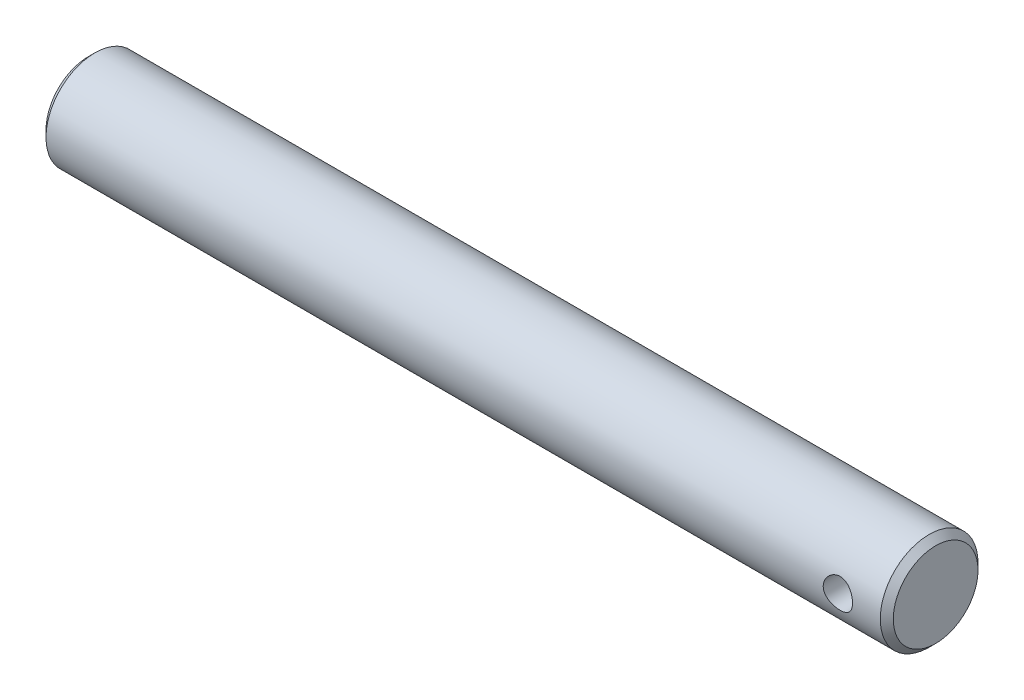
ISO-10303-21;
HEADER;
FILE_DESCRIPTION(('STEP AP214'),'2;1');
FILE_NAME('part.step','',(''),(''),'','','');
FILE_SCHEMA(('AUTOMOTIVE_DESIGN { 1 0 10303 214 1 1 1 1 }'));
ENDSEC;
DATA;
#1=APPLICATION_CONTEXT('core data for automotive mechanical design processes');
#2=APPLICATION_PROTOCOL_DEFINITION('international standard','automotive_design',2000,#1);
#3=PRODUCT_CONTEXT('',#1,'mechanical');
#4=PRODUCT('Part','Part','',(#3));
#5=PRODUCT_RELATED_PRODUCT_CATEGORY('part','',(#4));
#6=PRODUCT_DEFINITION_FORMATION('','',#4);
#7=PRODUCT_DEFINITION_CONTEXT('part definition',#1,'design');
#8=PRODUCT_DEFINITION('design','',#6,#7);
#9=PRODUCT_DEFINITION_SHAPE('','',#8);
#10=(LENGTH_UNIT() NAMED_UNIT(*) SI_UNIT(.MILLI.,.METRE.));
#11=(NAMED_UNIT(*) PLANE_ANGLE_UNIT() SI_UNIT($,.RADIAN.));
#12=(NAMED_UNIT(*) SI_UNIT($,.STERADIAN.) SOLID_ANGLE_UNIT());
#13=UNCERTAINTY_MEASURE_WITH_UNIT(LENGTH_MEASURE(1.E-05),#10,'distance_accuracy_value','');
#14=(GEOMETRIC_REPRESENTATION_CONTEXT(3) GLOBAL_UNCERTAINTY_ASSIGNED_CONTEXT((#13)) GLOBAL_UNIT_ASSIGNED_CONTEXT((#10,
#11,#12)) REPRESENTATION_CONTEXT('',''));
#15=CARTESIAN_POINT('',(0.,0.,0.));
#16=DIRECTION('',(0.,0.,1.));
#17=DIRECTION('',(1.,0.,0.));
#18=AXIS2_PLACEMENT_3D('',#15,#16,#17);
#19=CARTESIAN_POINT('',(0.,0.,0.));
#20=DIRECTION('',(1.,0.,0.));
#21=DIRECTION('',(0.,0.,-1.));
#22=AXIS2_PLACEMENT_3D('',#19,#20,#21);
#23=PLANE('',#22);
#24=CARTESIAN_POINT('',(0.,0.,0.));
#25=DIRECTION('',(1.,0.,0.));
#26=DIRECTION('',(0.,0.,-1.));
#27=AXIS2_PLACEMENT_3D('',#24,#25,#26);
#28=CIRCLE('',#27,6.49999999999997);
#29=CARTESIAN_POINT('',(0.,0.,-6.49999999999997));
#30=VERTEX_POINT('',#29);
#31=EDGE_CURVE('E36',#30,#30,#28,.T.);
#32=ORIENTED_EDGE('',*,*,#31,.T.);
#33=EDGE_LOOP('',(#32));
#34=FACE_BOUND('',#33,.T.);
#35=ADVANCED_FACE('F22',(#34),#23,.T.);
#36=CARTESIAN_POINT('',(40.,0.,0.));
#37=DIRECTION('',(1.,0.,0.));
#38=DIRECTION('',(0.,0.,-1.));
#39=AXIS2_PLACEMENT_3D('',#36,#37,#38);
#40=CYLINDRICAL_SURFACE('',#39,7.49999999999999);
#41=CARTESIAN_POINT('',(-1.00000000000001,0.,0.));
#42=DIRECTION('',(1.,0.,0.));
#43=DIRECTION('',(0.,0.,-1.));
#44=AXIS2_PLACEMENT_3D('',#41,#42,#43);
#45=CIRCLE('',#44,7.49999999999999);
#46=CARTESIAN_POINT('',(-1.00000000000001,0.,-7.49999999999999));
#47=VERTEX_POINT('',#46);
#48=EDGE_CURVE('E28',#47,#47,#45,.F.);
#49=ORIENTED_EDGE('',*,*,#48,.T.);
#50=EDGE_LOOP('',(#49));
#51=FACE_BOUND('',#50,.T.);
#52=CARTESIAN_POINT('',(-129.,0.,0.));
#53=DIRECTION('',(-1.,0.,0.));
#54=DIRECTION('',(0.,0.,1.));
#55=AXIS2_PLACEMENT_3D('',#52,#53,#54);
#56=CIRCLE('',#55,7.49999999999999);
#57=CARTESIAN_POINT('',(-129.,0.,7.49999999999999));
#58=VERTEX_POINT('',#57);
#59=EDGE_CURVE('E32',#58,#58,#56,.F.);
#60=ORIENTED_EDGE('',*,*,#59,.T.);
#61=EDGE_LOOP('',(#60));
#62=FACE_BOUND('',#61,.T.);
#63=CARTESIAN_POINT('',(-9.75,0.,-7.49999999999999));
#64=CARTESIAN_POINT('',(-9.74999850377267,0.12343291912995,-7.49999893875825));
#65=CARTESIAN_POINT('',(-9.73980920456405,0.246880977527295,-7.4969237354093));
#66=CARTESIAN_POINT('',(-9.69941796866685,0.490182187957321,-7.48495658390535));
#67=CARTESIAN_POINT('',(-9.66921006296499,0.61003425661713,-7.47606290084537));
#68=CARTESIAN_POINT('',(-9.58988097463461,0.84259906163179,-7.45343328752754));
#69=CARTESIAN_POINT('',(-9.5407876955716,0.955322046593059,-7.43970450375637));
#70=CARTESIAN_POINT('',(-9.42519586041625,1.1709362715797,-7.40883163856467));
#71=CARTESIAN_POINT('',(-9.35869498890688,1.2738262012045,-7.39168710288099));
#72=CARTESIAN_POINT('',(-9.208163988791,1.46980769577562,-7.3552610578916));
#73=CARTESIAN_POINT('',(-9.12372506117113,1.56257710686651,-7.33593575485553));
#74=CARTESIAN_POINT('',(-8.94058615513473,1.73287381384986,-7.29758751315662));
#75=CARTESIAN_POINT('',(-8.84188378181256,1.81039854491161,-7.27856462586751));
#76=CARTESIAN_POINT('',(-8.63029387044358,1.94970056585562,-7.24251170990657));
#77=CARTESIAN_POINT('',(-8.51713730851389,2.0110846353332,-7.22553609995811));
#78=CARTESIAN_POINT('',(-8.28151611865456,2.11382092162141,-7.19615430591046));
#79=CARTESIAN_POINT('',(-8.15905373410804,2.1551779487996,-7.18374702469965));
#80=CARTESIAN_POINT('',(-7.91191460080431,2.21552450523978,-7.16536306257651));
#81=CARTESIAN_POINT('',(-7.78739588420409,2.23510794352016,-7.15921603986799));
#82=CARTESIAN_POINT('',(-7.53670026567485,2.25320595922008,-7.1535418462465));
#83=CARTESIAN_POINT('',(-7.41052377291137,2.25172564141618,-7.15401307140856));
#84=CARTESIAN_POINT('',(-7.16492413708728,2.22820465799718,-7.16137116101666));
#85=CARTESIAN_POINT('',(-7.04542162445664,2.20690807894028,-7.1680258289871));
#86=CARTESIAN_POINT('',(-6.81177032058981,2.14556130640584,-7.18662534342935));
#87=CARTESIAN_POINT('',(-6.6976220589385,2.10550926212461,-7.19857071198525));
#88=CARTESIAN_POINT('',(-6.47609947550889,2.00724039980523,-7.22659099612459));
#89=CARTESIAN_POINT('',(-6.36883937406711,1.94878225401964,-7.24272024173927));
#90=CARTESIAN_POINT('',(-6.16540196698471,1.81552833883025,-7.27726480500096));
#91=CARTESIAN_POINT('',(-6.06922735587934,1.74072861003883,-7.29568067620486));
#92=CARTESIAN_POINT('',(-5.88647071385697,1.5732193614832,-7.33366516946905));
#93=CARTESIAN_POINT('',(-5.8004570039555,1.47989236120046,-7.35324981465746));
#94=CARTESIAN_POINT('',(-5.64516902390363,1.27989488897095,-7.39068366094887));
#95=CARTESIAN_POINT('',(-5.57589580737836,1.17322357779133,-7.40853275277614));
#96=CARTESIAN_POINT('',(-5.4557101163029,0.948532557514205,-7.44064740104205));
#97=CARTESIAN_POINT('',(-5.40492372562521,0.830441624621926,-7.4548881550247));
#98=CARTESIAN_POINT('',(-5.32410061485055,0.586868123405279,-7.47800282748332));
#99=CARTESIAN_POINT('',(-5.29405810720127,0.461387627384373,-7.48687824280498));
#100=CARTESIAN_POINT('',(-5.25652173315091,0.211428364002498,-7.49802546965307));
#101=CARTESIAN_POINT('',(-5.24825762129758,0.0870751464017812,-7.50052275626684));
#102=CARTESIAN_POINT('',(-5.25235373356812,-0.161249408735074,-7.49929384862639));
#103=CARTESIAN_POINT('',(-5.26471120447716,-0.28522079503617,-7.49556848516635));
#104=CARTESIAN_POINT('',(-5.30907691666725,-0.526355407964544,-7.48246045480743));
#105=CARTESIAN_POINT('',(-5.34063508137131,-0.643609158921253,-7.47320744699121));
#106=CARTESIAN_POINT('',(-5.4219648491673,-0.871131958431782,-7.45011521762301));
#107=CARTESIAN_POINT('',(-5.47173864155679,-0.981400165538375,-7.4362754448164));
#108=CARTESIAN_POINT('',(-5.5893797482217,-1.19465578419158,-7.40504481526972));
#109=CARTESIAN_POINT('',(-5.65763901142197,-1.2974157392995,-7.38757921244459));
#110=CARTESIAN_POINT('',(-5.80983713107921,-1.49028496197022,-7.35110203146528));
#111=CARTESIAN_POINT('',(-5.89377991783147,-1.58039104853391,-7.33209006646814));
#112=CARTESIAN_POINT('',(-6.07858096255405,-1.74878616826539,-7.29379757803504));
#113=CARTESIAN_POINT('',(-6.17994281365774,-1.82652721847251,-7.27453237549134));
#114=CARTESIAN_POINT('',(-6.39469190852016,-1.96393492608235,-7.23864772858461));
#115=CARTESIAN_POINT('',(-6.50807883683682,-2.02360205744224,-7.2220282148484));
#116=CARTESIAN_POINT('',(-6.74329873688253,-2.12276020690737,-7.19350784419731));
#117=CARTESIAN_POINT('',(-6.86508927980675,-2.16234520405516,-7.18158506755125));
#118=CARTESIAN_POINT('',(-7.11403195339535,-2.2203259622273,-7.16387391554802));
#119=CARTESIAN_POINT('',(-7.24118223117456,-2.23872898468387,-7.15808343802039));
#120=CARTESIAN_POINT('',(-7.49154227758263,-2.25332976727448,-7.15349958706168));
#121=CARTESIAN_POINT('',(-7.61469547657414,-2.25042082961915,-7.15442471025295));
#122=CARTESIAN_POINT('',(-7.85867115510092,-2.22461258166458,-7.1624910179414));
#123=CARTESIAN_POINT('',(-7.97949372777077,-2.20171407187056,-7.16963195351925));
#124=CARTESIAN_POINT('',(-8.21391809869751,-2.13715333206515,-7.18913645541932));
#125=CARTESIAN_POINT('',(-8.32759093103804,-2.09572763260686,-7.201434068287));
#126=CARTESIAN_POINT('',(-8.54646365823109,-1.99547260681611,-7.22985418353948));
#127=CARTESIAN_POINT('',(-8.65166192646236,-1.93663994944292,-7.24597741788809));
#128=CARTESIAN_POINT('',(-8.8547446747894,-1.80073145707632,-7.28096514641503));
#129=CARTESIAN_POINT('',(-8.95222314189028,-1.72306914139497,-7.29990810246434));
#130=CARTESIAN_POINT('',(-9.13305374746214,-1.55276151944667,-7.33801980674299));
#131=CARTESIAN_POINT('',(-9.21640220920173,-1.46011232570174,-7.35718861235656));
#132=CARTESIAN_POINT('',(-9.36903511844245,-1.25919864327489,-7.39426404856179));
#133=CARTESIAN_POINT('',(-9.43783717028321,-1.15055682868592,-7.41211739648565));
#134=CARTESIAN_POINT('',(-9.55610275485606,-0.92271206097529,-7.44391020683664));
#135=CARTESIAN_POINT('',(-9.60557533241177,-0.803514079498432,-7.45785149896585));
#136=CARTESIAN_POINT('',(-9.67934291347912,-0.571136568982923,-7.47903262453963));
#137=CARTESIAN_POINT('',(-9.70576750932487,-0.458680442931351,-7.48683041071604));
#138=CARTESIAN_POINT('',(-9.74109528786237,-0.230820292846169,-7.49731416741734));
#139=CARTESIAN_POINT('',(-9.75000139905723,-0.115416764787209,-7.50000099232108));
#140=CARTESIAN_POINT('',(-9.75,0.,-7.49999999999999));
#141=B_SPLINE_CURVE_WITH_KNOTS('',3,(#63,#64,#65,#66,#67,#68,#69,#70,#71,#72,#73,#74,#75,#76,
#77,#78,#79,#80,#81,#82,#83,#84,#85,#86,#87,#88,#89,#90,#91,#92,#93,#94,#95,#96,#97,#98,#99,
#100,#101,#102,#103,#104,#105,#106,#107,#108,#109,#110,#111,#112,#113,#114,#115,#116,#117,#118,
#119,#120,#121,#122,#123,#124,#125,#126,#127,#128,#129,#130,#131,#132,#133,#134,#135,#136,#137,
#138,#139,#140),.UNSPECIFIED.,.T.,.F.,(4,2,2,2,2,2,2,2,2,2,2,2,2,2,2,2,2,2,2,2,2,2,2,2,2,2,2,2,
2,2,2,2,2,2,2,2,2,2,4),(0.,0.369874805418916,0.739859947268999,1.10930051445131,
1.47879024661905,1.85783404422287,2.23694155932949,2.62457221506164,3.01210971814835,
3.38879534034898,3.76538967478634,4.12839025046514,4.49142665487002,4.85943639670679,
5.22753540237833,5.6110065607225,5.99450184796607,6.38056570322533,6.76652180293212,
7.13863214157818,7.5106928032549,7.8743512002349,8.23805331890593,8.61016958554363,
8.98237923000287,9.36810600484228,9.75382266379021,10.1377172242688,10.5214801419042,
10.8892523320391,11.2570097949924,11.6202006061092,11.983460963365,12.3599538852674,
12.7365446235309,13.1241449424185,13.5115636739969,13.8574753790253,14.2033292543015),.UNSPECIFIED.);
#142=CARTESIAN_POINT('',(-9.75,0.,-7.49999999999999));
#143=VERTEX_POINT('',#142);
#144=EDGE_CURVE('E41',#143,#143,#141,.T.);
#145=ORIENTED_EDGE('',*,*,#144,.F.);
#146=EDGE_LOOP('',(#145));
#147=FACE_BOUND('',#146,.T.);
#148=CARTESIAN_POINT('',(-5.25,0.,7.49999999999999));
#149=CARTESIAN_POINT('',(-5.25000149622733,0.12343291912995,7.49999893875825));
#150=CARTESIAN_POINT('',(-5.26019079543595,0.246880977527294,7.4969237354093));
#151=CARTESIAN_POINT('',(-5.30058203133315,0.490182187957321,7.48495658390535));
#152=CARTESIAN_POINT('',(-5.33078993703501,0.61003425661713,7.47606290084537));
#153=CARTESIAN_POINT('',(-5.4101190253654,0.842599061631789,7.45343328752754));
#154=CARTESIAN_POINT('',(-5.45921230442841,0.955322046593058,7.43970450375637));
#155=CARTESIAN_POINT('',(-5.57480413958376,1.1709362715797,7.40883163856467));
#156=CARTESIAN_POINT('',(-5.64130501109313,1.2738262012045,7.39168710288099));
#157=CARTESIAN_POINT('',(-5.791836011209,1.46980769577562,7.3552610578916));
#158=CARTESIAN_POINT('',(-5.87627493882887,1.56257710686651,7.33593575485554));
#159=CARTESIAN_POINT('',(-6.05941384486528,1.73287381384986,7.29758751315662));
#160=CARTESIAN_POINT('',(-6.15811621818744,1.81039854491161,7.27856462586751));
#161=CARTESIAN_POINT('',(-6.36970612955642,1.94970056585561,7.24251170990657));
#162=CARTESIAN_POINT('',(-6.48286269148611,2.0110846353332,7.22553609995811));
#163=CARTESIAN_POINT('',(-6.71848388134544,2.11382092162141,7.19615430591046));
#164=CARTESIAN_POINT('',(-6.84094626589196,2.1551779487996,7.18374702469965));
#165=CARTESIAN_POINT('',(-7.08808539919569,2.21552450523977,7.16536306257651));
#166=CARTESIAN_POINT('',(-7.21260411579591,2.23510794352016,7.15921603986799));
#167=CARTESIAN_POINT('',(-7.46329973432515,2.25320595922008,7.1535418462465));
#168=CARTESIAN_POINT('',(-7.58947622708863,2.25172564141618,7.15401307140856));
#169=CARTESIAN_POINT('',(-7.83507586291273,2.22820465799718,7.16137116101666));
#170=CARTESIAN_POINT('',(-7.95457837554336,2.20690807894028,7.1680258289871));
#171=CARTESIAN_POINT('',(-8.18822967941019,2.14556130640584,7.18662534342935));
#172=CARTESIAN_POINT('',(-8.3023779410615,2.10550926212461,7.19857071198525));
#173=CARTESIAN_POINT('',(-8.52390052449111,2.00724039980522,7.22659099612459));
#174=CARTESIAN_POINT('',(-8.63116062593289,1.94878225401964,7.24272024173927));
#175=CARTESIAN_POINT('',(-8.83459803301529,1.81552833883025,7.27726480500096));
#176=CARTESIAN_POINT('',(-8.93077264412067,1.74072861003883,7.29568067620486));
#177=CARTESIAN_POINT('',(-9.11352928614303,1.5732193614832,7.33366516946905));
#178=CARTESIAN_POINT('',(-9.19954299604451,1.47989236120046,7.35324981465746));
#179=CARTESIAN_POINT('',(-9.35483097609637,1.27989488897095,7.39068366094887));
#180=CARTESIAN_POINT('',(-9.42410419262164,1.17322357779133,7.40853275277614));
#181=CARTESIAN_POINT('',(-9.5442898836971,0.948532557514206,7.44064740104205));
#182=CARTESIAN_POINT('',(-9.5950762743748,0.830441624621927,7.4548881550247));
#183=CARTESIAN_POINT('',(-9.67589938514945,0.58686812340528,7.47800282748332));
#184=CARTESIAN_POINT('',(-9.70594189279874,0.461387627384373,7.48687824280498));
#185=CARTESIAN_POINT('',(-9.74347826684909,0.211428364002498,7.49802546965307));
#186=CARTESIAN_POINT('',(-9.75174237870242,0.0870751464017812,7.50052275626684));
#187=CARTESIAN_POINT('',(-9.74764626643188,-0.161249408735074,7.49929384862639));
#188=CARTESIAN_POINT('',(-9.73528879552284,-0.28522079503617,7.49556848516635));
#189=CARTESIAN_POINT('',(-9.69092308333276,-0.526355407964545,7.48246045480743));
#190=CARTESIAN_POINT('',(-9.6593649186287,-0.643609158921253,7.47320744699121));
#191=CARTESIAN_POINT('',(-9.5780351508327,-0.871131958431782,7.45011521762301));
#192=CARTESIAN_POINT('',(-9.52826135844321,-0.981400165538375,7.4362754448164));
#193=CARTESIAN_POINT('',(-9.4106202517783,-1.19465578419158,7.40504481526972));
#194=CARTESIAN_POINT('',(-9.34236098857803,-1.2974157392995,7.38757921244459));
#195=CARTESIAN_POINT('',(-9.1901628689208,-1.49028496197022,7.35110203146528));
#196=CARTESIAN_POINT('',(-9.10622008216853,-1.58039104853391,7.33209006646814));
#197=CARTESIAN_POINT('',(-8.92141903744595,-1.74878616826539,7.29379757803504));
#198=CARTESIAN_POINT('',(-8.82005718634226,-1.82652721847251,7.27453237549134));
#199=CARTESIAN_POINT('',(-8.60530809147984,-1.96393492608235,7.23864772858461));
#200=CARTESIAN_POINT('',(-8.49192116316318,-2.02360205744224,7.2220282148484));
#201=CARTESIAN_POINT('',(-8.25670126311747,-2.12276020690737,7.19350784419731));
#202=CARTESIAN_POINT('',(-8.13491072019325,-2.16234520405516,7.18158506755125));
#203=CARTESIAN_POINT('',(-7.88596804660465,-2.2203259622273,7.16387391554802));
#204=CARTESIAN_POINT('',(-7.75881776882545,-2.23872898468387,7.15808343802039));
#205=CARTESIAN_POINT('',(-7.50845772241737,-2.25332976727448,7.15349958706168));
#206=CARTESIAN_POINT('',(-7.38530452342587,-2.25042082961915,7.15442471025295));
#207=CARTESIAN_POINT('',(-7.14132884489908,-2.22461258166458,7.1624910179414));
#208=CARTESIAN_POINT('',(-7.02050627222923,-2.20171407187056,7.16963195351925));
#209=CARTESIAN_POINT('',(-6.78608190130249,-2.13715333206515,7.18913645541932));
#210=CARTESIAN_POINT('',(-6.67240906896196,-2.09572763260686,7.201434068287));
#211=CARTESIAN_POINT('',(-6.45353634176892,-1.99547260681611,7.22985418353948));
#212=CARTESIAN_POINT('',(-6.34833807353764,-1.93663994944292,7.24597741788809));
#213=CARTESIAN_POINT('',(-6.1452553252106,-1.80073145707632,7.28096514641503));
#214=CARTESIAN_POINT('',(-6.04777685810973,-1.72306914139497,7.29990810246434));
#215=CARTESIAN_POINT('',(-5.86694625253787,-1.55276151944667,7.33801980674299));
#216=CARTESIAN_POINT('',(-5.78359779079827,-1.46011232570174,7.35718861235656));
#217=CARTESIAN_POINT('',(-5.63096488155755,-1.25919864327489,7.39426404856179));
#218=CARTESIAN_POINT('',(-5.56216282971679,-1.15055682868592,7.41211739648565));
#219=CARTESIAN_POINT('',(-5.44389724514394,-0.92271206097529,7.44391020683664));
#220=CARTESIAN_POINT('',(-5.39442466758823,-0.803514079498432,7.45785149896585));
#221=CARTESIAN_POINT('',(-5.32065708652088,-0.571136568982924,7.47903262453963));
#222=CARTESIAN_POINT('',(-5.29423249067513,-0.458680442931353,7.48683041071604));
#223=CARTESIAN_POINT('',(-5.25890471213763,-0.23082029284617,7.49731416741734));
#224=CARTESIAN_POINT('',(-5.24999860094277,-0.11541676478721,7.50000099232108));
#225=CARTESIAN_POINT('',(-5.25,0.,7.49999999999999));
#226=B_SPLINE_CURVE_WITH_KNOTS('',3,(#148,#149,#150,#151,#152,#153,#154,#155,#156,#157,#158,
#159,#160,#161,#162,#163,#164,#165,#166,#167,#168,#169,#170,#171,#172,#173,#174,#175,#176,#177,
#178,#179,#180,#181,#182,#183,#184,#185,#186,#187,#188,#189,#190,#191,#192,#193,#194,#195,#196,
#197,#198,#199,#200,#201,#202,#203,#204,#205,#206,#207,#208,#209,#210,#211,#212,#213,#214,#215,
#216,#217,#218,#219,#220,#221,#222,#223,#224,#225),.UNSPECIFIED.,.T.,.F.,(4,2,2,2,2,2,2,2,2,2,2,
2,2,2,2,2,2,2,2,2,2,2,2,2,2,2,2,2,2,2,2,2,2,2,2,2,2,2,4),(0.,0.369874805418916,
0.739859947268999,1.10930051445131,1.47879024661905,1.85783404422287,2.23694155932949,
2.62457221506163,3.01210971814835,3.38879534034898,3.76538967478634,4.12839025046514,
4.49142665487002,4.85943639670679,5.22753540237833,5.6110065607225,5.99450184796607,
6.38056570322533,6.76652180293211,7.13863214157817,7.5106928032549,7.8743512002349,
8.23805331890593,8.61016958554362,8.98237923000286,9.36810600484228,9.75382266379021,
10.1377172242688,10.5214801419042,10.8892523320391,11.2570097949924,11.6202006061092,
11.983460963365,12.3599538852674,12.7365446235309,13.1241449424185,13.5115636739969,
13.8574753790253,14.2033292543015),.UNSPECIFIED.);
#227=CARTESIAN_POINT('',(-5.25,0.,7.49999999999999));
#228=VERTEX_POINT('',#227);
#229=EDGE_CURVE('E47',#228,#228,#226,.T.);
#230=ORIENTED_EDGE('',*,*,#229,.F.);
#231=EDGE_LOOP('',(#230));
#232=FACE_BOUND('',#231,.T.);
#233=ADVANCED_FACE('F50',(#51,#62,#147,#232),#40,.T.);
#234=CARTESIAN_POINT('',(-130.,0.,0.));
#235=DIRECTION('',(-1.,0.,0.));
#236=DIRECTION('',(0.,0.,1.));
#237=AXIS2_PLACEMENT_3D('',#234,#235,#236);
#238=PLANE('',#237);
#239=CARTESIAN_POINT('',(-130.,0.,0.));
#240=DIRECTION('',(-1.,0.,0.));
#241=DIRECTION('',(0.,0.,1.));
#242=AXIS2_PLACEMENT_3D('',#239,#240,#241);
#243=CIRCLE('',#242,6.49999999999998);
#244=CARTESIAN_POINT('',(-130.,0.,6.49999999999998));
#245=VERTEX_POINT('',#244);
#246=EDGE_CURVE('E10',#245,#245,#243,.T.);
#247=ORIENTED_EDGE('',*,*,#246,.T.);
#248=EDGE_LOOP('',(#247));
#249=FACE_BOUND('',#248,.T.);
#250=ADVANCED_FACE('F58',(#249),#238,.T.);
#251=CARTESIAN_POINT('',(-7.5,0.,-50.));
#252=DIRECTION('',(0.,0.,1.));
#253=DIRECTION('',(1.,0.,0.));
#254=AXIS2_PLACEMENT_3D('',#251,#252,#253);
#255=CYLINDRICAL_SURFACE('',#254,2.25);
#256=ORIENTED_EDGE('',*,*,#144,.T.);
#257=EDGE_LOOP('',(#256));
#258=FACE_BOUND('',#257,.T.);
#259=ORIENTED_EDGE('',*,*,#229,.T.);
#260=EDGE_LOOP('',(#259));
#261=FACE_BOUND('',#260,.T.);
#262=ADVANCED_FACE('F53',(#258,#261),#255,.F.);
#263=CARTESIAN_POINT('',(0.,0.,0.));
#264=DIRECTION('',(-1.,0.,0.));
#265=DIRECTION('',(0.,0.,1.));
#266=AXIS2_PLACEMENT_3D('',#263,#264,#265);
#267=CONICAL_SURFACE('',#266,6.49999999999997,0.785398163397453);
#268=ORIENTED_EDGE('',*,*,#48,.F.);
#269=EDGE_LOOP('',(#268));
#270=FACE_BOUND('',#269,.T.);
#271=ORIENTED_EDGE('',*,*,#31,.F.);
#272=EDGE_LOOP('',(#271));
#273=FACE_BOUND('',#272,.T.);
#274=ADVANCED_FACE('F57',(#270,#273),#267,.T.);
#275=CARTESIAN_POINT('',(-129.,0.,0.));
#276=DIRECTION('',(1.,0.,0.));
#277=DIRECTION('',(0.,0.,-1.));
#278=AXIS2_PLACEMENT_3D('',#275,#276,#277);
#279=CONICAL_SURFACE('',#278,7.49999999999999,0.785398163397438);
#280=ORIENTED_EDGE('',*,*,#246,.F.);
#281=EDGE_LOOP('',(#280));
#282=FACE_BOUND('',#281,.T.);
#283=ORIENTED_EDGE('',*,*,#59,.F.);
#284=EDGE_LOOP('',(#283));
#285=FACE_BOUND('',#284,.T.);
#286=ADVANCED_FACE('F73',(#282,#285),#279,.T.);
#287=CLOSED_SHELL('',(#35,#233,#250,#262,#274,#286));
#288=MANIFOLD_SOLID_BREP('B2',#287);
#289=ADVANCED_BREP_SHAPE_REPRESENTATION('',(#18,#288),#14);
#290=SHAPE_DEFINITION_REPRESENTATION(#9,#289);
ENDSEC;
END-ISO-10303-21;
